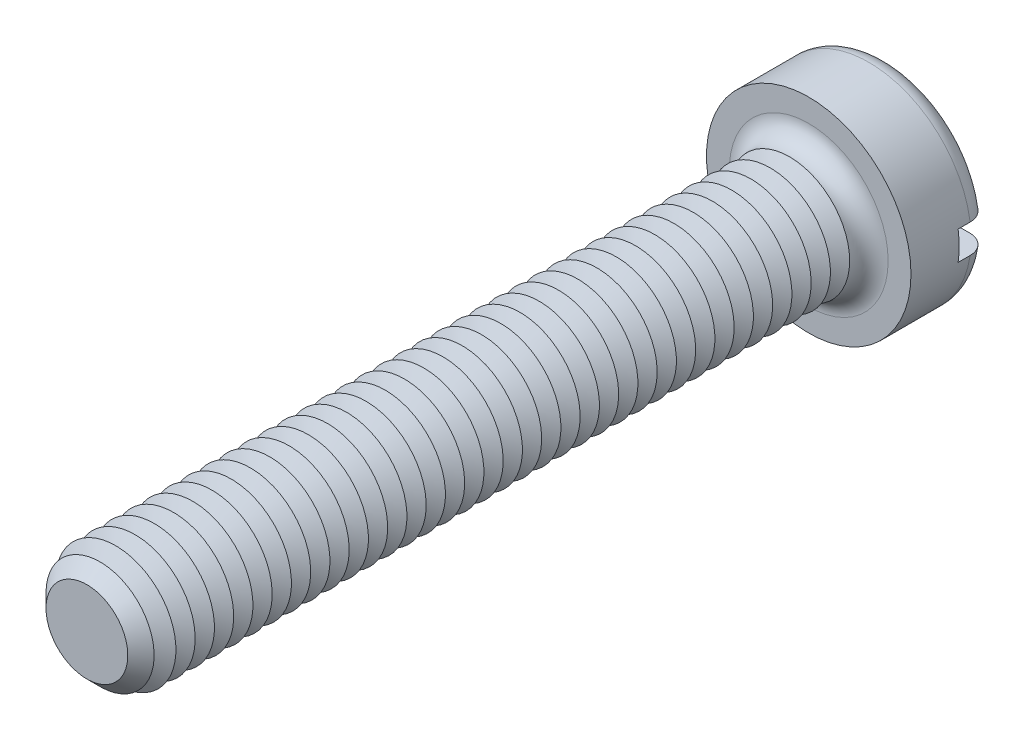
from build123d import *

# Parameters (mm, degrees)
SKETCH3_R           = 4.25
BOSS_EXTRUDE2_DEPTH = 3.3
SKETCH4_R           = 2.5
BOSS_EXTRUDE3_DEPTH = 30
FILLET1_R           = 0.8
CHAMFER1_SIZE       = 0.8
LPATTERN1_COUNT     = 36
LPATTERN1_PITCH     = 0.8
SKETCH8_W           = 8.5
SKETCH8_H           = 1.2
CUT_EXTRUDE1_DEPTH  = 1.3


with BuildPart() as part:
    # Sketch3 → Boss-Extrude2 (new body)
    with BuildSketch(Plane.XY):
        Circle(SKETCH3_R)
    extrude(amount=-BOSS_EXTRUDE2_DEPTH)

    # Sketch4 → Boss-Extrude3 (add)
    with BuildSketch(Plane.XY):
        Circle(SKETCH4_R)
    extrude(amount=BOSS_EXTRUDE3_DEPTH)

    # Fillet1
    fillet1_edges = [part.edges().sort_by_distance(p)[0] for p in [
        (-4.25, 0, -3.3),
        (-2.5, 0, 0),
    ]]
    fillet(fillet1_edges, radius=FILLET1_R)

    # Chamfer1
    chamfer1_edges = [part.edges().sort_by_distance(p)[0] for p in [
        (-2.5, 0, 30),
    ]]
    chamfer(chamfer1_edges, length=CHAMFER1_SIZE)

    # Sketch6 → Cut-Revolve1 (revolve, cut)
    with BuildSketch(Plane(origin=(0, 0, 0), x_dir=(0, 0, -1), z_dir=(1, 0, 0)), mode=Mode.PRIVATE) as cut_revolve1_sk:
        Polygon((-0.8, 2.5), (-1.2, 1.807179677), (-1.6, 2.5), align=None)
    cut_revolve1 = revolve(cut_revolve1_sk.sketch.rotate(Axis((0, 0, -1.694361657), (0, 0, 1)), 90), axis=Axis((0, 0, -1.694361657), (0, 0, 1)), mode=Mode.SUBTRACT)

    # LPattern1: Cut-Revolve1 ×36
    with Locations(*[(0, 0, i * LPATTERN1_PITCH) for i in range(1, LPATTERN1_COUNT)]):
        add(cut_revolve1, mode=Mode.SUBTRACT)

    # Sketch8 → Cut-Extrude1 (cut)
    with BuildSketch(Plane(origin=(0, 0, -3.3), x_dir=(-1, 0, 0), z_dir=(0, 0, -1))):
        Rectangle(SKETCH8_W, SKETCH8_H)
    extrude(amount=-CUT_EXTRUDE1_DEPTH, mode=Mode.SUBTRACT)


solid = part.part
